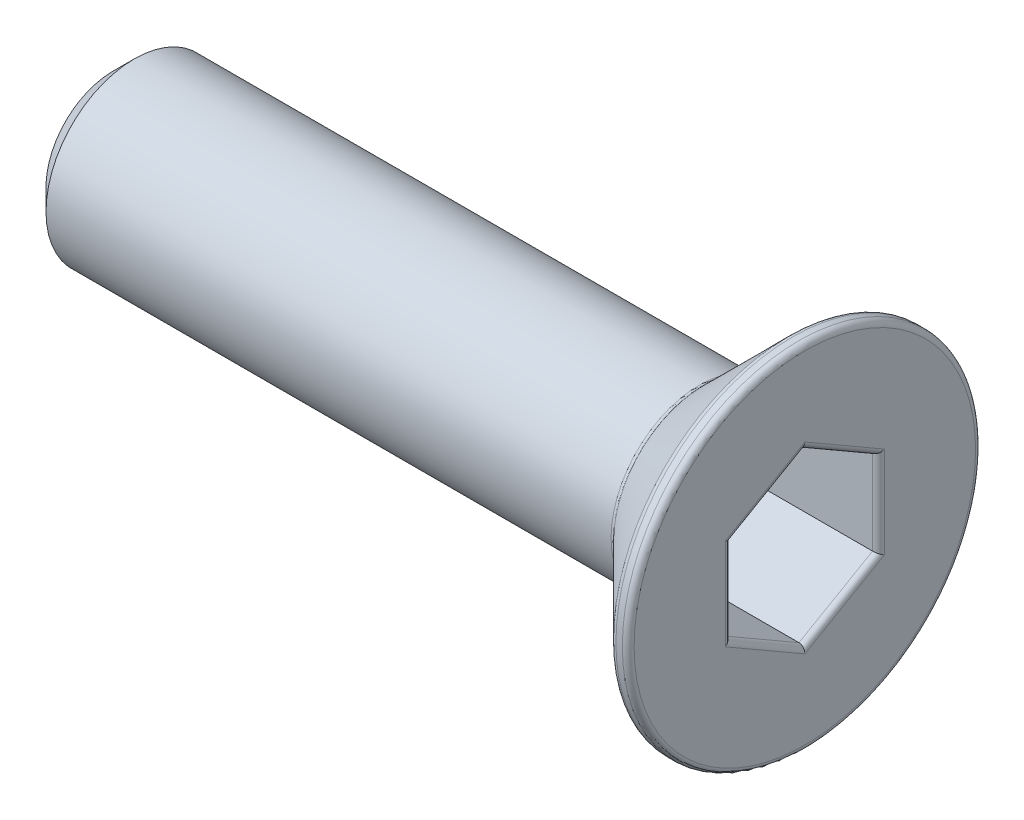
ISO-10303-21;
HEADER;
FILE_DESCRIPTION(('STEP AP214'),'2;1');
FILE_NAME('part.step','',(''),(''),'','','');
FILE_SCHEMA(('AUTOMOTIVE_DESIGN { 1 0 10303 214 1 1 1 1 }'));
ENDSEC;
DATA;
#1=APPLICATION_CONTEXT('core data for automotive mechanical design processes');
#2=APPLICATION_PROTOCOL_DEFINITION('international standard','automotive_design',2000,#1);
#3=PRODUCT_CONTEXT('',#1,'mechanical');
#4=PRODUCT('Part','Part','',(#3));
#5=PRODUCT_RELATED_PRODUCT_CATEGORY('part','',(#4));
#6=PRODUCT_DEFINITION_FORMATION('','',#4);
#7=PRODUCT_DEFINITION_CONTEXT('part definition',#1,'design');
#8=PRODUCT_DEFINITION('design','',#6,#7);
#9=PRODUCT_DEFINITION_SHAPE('','',#8);
#10=(LENGTH_UNIT() NAMED_UNIT(*) SI_UNIT(.MILLI.,.METRE.));
#11=(NAMED_UNIT(*) PLANE_ANGLE_UNIT() SI_UNIT($,.RADIAN.));
#12=(NAMED_UNIT(*) SI_UNIT($,.STERADIAN.) SOLID_ANGLE_UNIT());
#13=UNCERTAINTY_MEASURE_WITH_UNIT(LENGTH_MEASURE(1.E-05),#10,'distance_accuracy_value','');
#14=(GEOMETRIC_REPRESENTATION_CONTEXT(3) GLOBAL_UNCERTAINTY_ASSIGNED_CONTEXT((#13)) GLOBAL_UNIT_ASSIGNED_CONTEXT((#10,
#11,#12)) REPRESENTATION_CONTEXT('',''));
#15=CARTESIAN_POINT('',(0.,0.,0.));
#16=DIRECTION('',(0.,0.,1.));
#17=DIRECTION('',(1.,0.,0.));
#18=AXIS2_PLACEMENT_3D('',#15,#16,#17);
#19=CARTESIAN_POINT('',(0.,0.,0.));
#20=DIRECTION('',(-1.,0.,0.));
#21=DIRECTION('',(0.,0.,1.));
#22=AXIS2_PLACEMENT_3D('',#19,#20,#21);
#23=CYLINDRICAL_SURFACE('',#22,1.5);
#24=CARTESIAN_POINT('',(9.95857864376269,0.,0.));
#25=DIRECTION('',(-1.,0.,0.));
#26=DIRECTION('',(0.,0.,1.));
#27=AXIS2_PLACEMENT_3D('',#24,#25,#26);
#28=CIRCLE('',#27,1.5);
#29=CARTESIAN_POINT('',(9.95857864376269,0.,1.5));
#30=VERTEX_POINT('',#29);
#31=EDGE_CURVE('E161',#30,#30,#28,.T.);
#32=ORIENTED_EDGE('',*,*,#31,.T.);
#33=EDGE_LOOP('',(#32));
#34=FACE_BOUND('',#33,.T.);
#35=CARTESIAN_POINT('',(0.361358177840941,0.,0.));
#36=DIRECTION('',(1.,0.,0.));
#37=DIRECTION('',(0.,0.,-1.));
#38=AXIS2_PLACEMENT_3D('',#35,#36,#37);
#39=CIRCLE('',#38,1.5);
#40=CARTESIAN_POINT('',(0.361358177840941,0.,-1.5));
#41=VERTEX_POINT('',#40);
#42=EDGE_CURVE('E121',#41,#41,#39,.F.);
#43=ORIENTED_EDGE('',*,*,#42,.F.);
#44=EDGE_LOOP('',(#43));
#45=FACE_BOUND('',#44,.T.);
#46=ADVANCED_FACE('F30',(#34,#45),#23,.T.);
#47=CARTESIAN_POINT('',(11.75,3.,0.));
#48=DIRECTION('',(-1.,0.,0.));
#49=DIRECTION('',(0.,0.,1.));
#50=AXIS2_PLACEMENT_3D('',#47,#48,#49);
#51=PLANE('',#50);
#52=CARTESIAN_POINT('',(11.75,0.,0.));
#53=DIRECTION('',(-1.,0.,0.));
#54=DIRECTION('',(0.,0.,1.));
#55=AXIS2_PLACEMENT_3D('',#52,#53,#54);
#56=CIRCLE('',#55,2.9);
#57=CARTESIAN_POINT('',(11.75,0.,2.9));
#58=VERTEX_POINT('',#57);
#59=EDGE_CURVE('E177',#58,#58,#56,.F.);
#60=ORIENTED_EDGE('',*,*,#59,.T.);
#61=EDGE_LOOP('',(#60));
#62=FACE_BOUND('',#61,.T.);
#63=DIRECTION('',(0.,0.50000039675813,0.866025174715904));
#64=VECTOR('',#63,1.);
#65=CARTESIAN_POINT('',(11.75,1.91913517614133,0.624038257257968));
#66=LINE('',#65,#64);
#67=CARTESIAN_POINT('',(11.75,1.55884572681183,-7.14164727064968E-07));
#68=VERTEX_POINT('',#67);
#69=CARTESIAN_POINT('',(11.75,0.779422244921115,-1.35000035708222));
#70=VERTEX_POINT('',#69);
#71=EDGE_CURVE('E172',#68,#70,#66,.F.);
#72=ORIENTED_EDGE('',*,*,#71,.T.);
#73=DIRECTION('',(0.,0.999999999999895,-4.58136886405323E-07));
#74=VECTOR('',#73,1.);
#75=CARTESIAN_POINT('',(11.75,2.99999938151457,-1.35000137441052));
#76=LINE('',#75,#74);
#77=CARTESIAN_POINT('',(11.75,-0.77942348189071,-1.34999964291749));
#78=VERTEX_POINT('',#77);
#79=EDGE_CURVE('E174',#70,#78,#76,.F.);
#80=ORIENTED_EDGE('',*,*,#79,.T.);
#81=DIRECTION('',(0.,0.499999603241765,-0.866025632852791));
#82=VECTOR('',#81,1.);
#83=CARTESIAN_POINT('',(11.75,-0.4191357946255,-1.97403688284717));
#84=LINE('',#83,#82);
#85=CARTESIAN_POINT('',(11.75,-1.55884572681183,7.14164728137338E-07));
#86=VERTEX_POINT('',#85);
#87=EDGE_CURVE('E164',#78,#86,#84,.F.);
#88=ORIENTED_EDGE('',*,*,#87,.T.);
#89=DIRECTION('',(0.,-0.50000039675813,-0.866025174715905));
#90=VECTOR('',#89,1.);
#91=CARTESIAN_POINT('',(11.75,-0.41913279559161,1.97403932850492));
#92=LINE('',#91,#90);
#93=CARTESIAN_POINT('',(11.75,-0.779422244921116,1.35000035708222));
#94=VERTEX_POINT('',#93);
#95=EDGE_CURVE('E166',#86,#94,#92,.F.);
#96=ORIENTED_EDGE('',*,*,#95,.T.);
#97=DIRECTION('',(0.,-0.999999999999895,4.58136886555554E-07));
#98=VECTOR('',#97,1.);
#99=CARTESIAN_POINT('',(11.75,3.00000061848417,1.3499986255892));
#100=LINE('',#99,#98);
#101=CARTESIAN_POINT('',(11.75,0.779423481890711,1.34999964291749));
#102=VERTEX_POINT('',#101);
#103=EDGE_CURVE('E168',#94,#102,#100,.F.);
#104=ORIENTED_EDGE('',*,*,#103,.T.);
#105=DIRECTION('',(0.,-0.499999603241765,0.866025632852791));
#106=VECTOR('',#105,1.);
#107=CARTESIAN_POINT('',(11.75,1.91913341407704,-0.624037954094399));
#108=LINE('',#107,#106);
#109=EDGE_CURVE('E170',#102,#68,#108,.F.);
#110=ORIENTED_EDGE('',*,*,#109,.T.);
#111=EDGE_LOOP('',(#72,#80,#88,#96,#104,#110));
#112=FACE_BOUND('',#111,.T.);
#113=ADVANCED_FACE('F32',(#62,#112),#51,.F.);
#114=CARTESIAN_POINT('',(0.,0.,0.));
#115=DIRECTION('',(-1.,0.,0.));
#116=DIRECTION('',(0.,0.,1.));
#117=AXIS2_PLACEMENT_3D('',#114,#115,#116);
#118=CYLINDRICAL_SURFACE('',#117,3.);
#119=CARTESIAN_POINT('',(11.5414213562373,0.,0.));
#120=DIRECTION('',(1.,0.,0.));
#121=DIRECTION('',(0.,0.,-1.));
#122=AXIS2_PLACEMENT_3D('',#119,#120,#121);
#123=CIRCLE('',#122,3.);
#124=CARTESIAN_POINT('',(11.5414213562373,0.,-3.));
#125=VERTEX_POINT('',#124);
#126=EDGE_CURVE('E158',#125,#125,#123,.T.);
#127=ORIENTED_EDGE('',*,*,#126,.T.);
#128=EDGE_LOOP('',(#127));
#129=FACE_BOUND('',#128,.T.);
#130=CARTESIAN_POINT('',(11.65,0.,0.));
#131=DIRECTION('',(-1.,0.,0.));
#132=DIRECTION('',(0.,0.,1.));
#133=AXIS2_PLACEMENT_3D('',#130,#131,#132);
#134=CIRCLE('',#133,3.);
#135=CARTESIAN_POINT('',(11.65,0.,3.));
#136=VERTEX_POINT('',#135);
#137=EDGE_CURVE('E155',#136,#136,#134,.T.);
#138=ORIENTED_EDGE('',*,*,#137,.T.);
#139=EDGE_LOOP('',(#138));
#140=FACE_BOUND('',#139,.T.);
#141=ADVANCED_FACE('F244',(#129,#140),#118,.T.);
#142=CARTESIAN_POINT('',(11.5,0.,0.));
#143=DIRECTION('',(1.,0.,0.));
#144=DIRECTION('',(0.,0.,-1.));
#145=AXIS2_PLACEMENT_3D('',#142,#143,#144);
#146=CONICAL_SURFACE('',#145,3.,0.78539816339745);
#147=CARTESIAN_POINT('',(11.4707106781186,0.,0.));
#148=DIRECTION('',(-1.,0.,0.));
#149=DIRECTION('',(0.,0.,1.));
#150=AXIS2_PLACEMENT_3D('',#147,#148,#149);
#151=CIRCLE('',#150,2.97071067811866);
#152=CARTESIAN_POINT('',(11.4707106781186,0.,2.97071067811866));
#153=VERTEX_POINT('',#152);
#154=EDGE_CURVE('E152',#153,#153,#151,.T.);
#155=ORIENTED_EDGE('',*,*,#154,.T.);
#156=EDGE_LOOP('',(#155));
#157=FACE_BOUND('',#156,.T.);
#158=CARTESIAN_POINT('',(10.0292893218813,0.,0.));
#159=DIRECTION('',(1.,0.,0.));
#160=DIRECTION('',(0.,0.,-1.));
#161=AXIS2_PLACEMENT_3D('',#158,#159,#160);
#162=CIRCLE('',#161,1.52928932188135);
#163=CARTESIAN_POINT('',(10.0292893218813,0.,-1.52928932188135));
#164=VERTEX_POINT('',#163);
#165=EDGE_CURVE('E137',#164,#164,#162,.T.);
#166=ORIENTED_EDGE('',*,*,#165,.T.);
#167=EDGE_LOOP('',(#166));
#168=FACE_BOUND('',#167,.T.);
#169=ADVANCED_FACE('F251',(#157,#168),#146,.T.);
#170=CARTESIAN_POINT('',(9.75,-0.721687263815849,1.25000033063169));
#171=DIRECTION('',(0.,-0.866025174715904,0.50000039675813));
#172=DIRECTION('',(0.,-0.50000039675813,-0.866025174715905));
#173=AXIS2_PLACEMENT_3D('',#170,#171,#172);
#174=PLANE('',#173);
#175=DIRECTION('',(1.,0.,0.));
#176=VECTOR('',#175,1.);
#177=CARTESIAN_POINT('',(9.75,-0.721687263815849,1.25000033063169));
#178=LINE('',#177,#176);
#179=CARTESIAN_POINT('',(9.75,-0.721687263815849,1.25000033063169));
#180=VERTEX_POINT('',#179);
#181=CARTESIAN_POINT('',(11.65,-0.721687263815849,1.25000033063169));
#182=VERTEX_POINT('',#181);
#183=EDGE_CURVE('E135',#180,#182,#178,.T.);
#184=ORIENTED_EDGE('',*,*,#183,.T.);
#185=DIRECTION('',(0.,-0.50000039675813,-0.866025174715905));
#186=VECTOR('',#185,1.);
#187=CARTESIAN_POINT('',(11.65,-0.721687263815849,1.25000033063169));
#188=LINE('',#187,#186);
#189=CARTESIAN_POINT('',(11.65,-1.44337567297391,6.61263637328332E-07));
#190=VERTEX_POINT('',#189);
#191=EDGE_CURVE('E38',#182,#190,#188,.T.);
#192=ORIENTED_EDGE('',*,*,#191,.T.);
#193=DIRECTION('',(1.,0.,0.));
#194=VECTOR('',#193,1.);
#195=CARTESIAN_POINT('',(9.75,-1.44337567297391,6.61263637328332E-07));
#196=LINE('',#195,#194);
#197=CARTESIAN_POINT('',(9.75,-1.44337567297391,6.61263637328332E-07));
#198=VERTEX_POINT('',#197);
#199=EDGE_CURVE('E98',#198,#190,#196,.T.);
#200=ORIENTED_EDGE('',*,*,#199,.F.);
#201=DIRECTION('',(0.,-0.50000039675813,-0.866025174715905));
#202=VECTOR('',#201,1.);
#203=CARTESIAN_POINT('',(9.75,-0.721687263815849,1.25000033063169));
#204=LINE('',#203,#202);
#205=EDGE_CURVE('E102',#180,#198,#204,.T.);
#206=ORIENTED_EDGE('',*,*,#205,.F.);
#207=EDGE_LOOP('',(#184,#192,#200,#206));
#208=FACE_BOUND('',#207,.T.);
#209=ADVANCED_FACE('F100',(#208),#174,.F.);
#210=CARTESIAN_POINT('',(9.75,0.721688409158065,1.24999966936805));
#211=DIRECTION('',(0.,4.58136886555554E-07,0.999999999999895));
#212=DIRECTION('',(0.,-0.999999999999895,4.58136886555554E-07));
#213=AXIS2_PLACEMENT_3D('',#210,#211,#212);
#214=PLANE('',#213);
#215=DIRECTION('',(1.,0.,0.));
#216=VECTOR('',#215,1.);
#217=CARTESIAN_POINT('',(9.75,0.721688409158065,1.24999966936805));
#218=LINE('',#217,#216);
#219=CARTESIAN_POINT('',(9.75,0.721688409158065,1.24999966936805));
#220=VERTEX_POINT('',#219);
#221=CARTESIAN_POINT('',(11.65,0.721688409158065,1.24999966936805));
#222=VERTEX_POINT('',#221);
#223=EDGE_CURVE('E138',#220,#222,#218,.T.);
#224=ORIENTED_EDGE('',*,*,#223,.T.);
#225=DIRECTION('',(0.,-0.999999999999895,4.58136886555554E-07));
#226=VECTOR('',#225,1.);
#227=CARTESIAN_POINT('',(11.65,0.721688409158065,1.24999966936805));
#228=LINE('',#227,#226);
#229=EDGE_CURVE('E52',#222,#182,#228,.T.);
#230=ORIENTED_EDGE('',*,*,#229,.T.);
#231=ORIENTED_EDGE('',*,*,#183,.F.);
#232=DIRECTION('',(0.,-0.999999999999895,4.58136886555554E-07));
#233=VECTOR('',#232,1.);
#234=CARTESIAN_POINT('',(9.75,0.721688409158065,1.24999966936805));
#235=LINE('',#234,#233);
#236=EDGE_CURVE('E107',#220,#180,#235,.T.);
#237=ORIENTED_EDGE('',*,*,#236,.F.);
#238=EDGE_LOOP('',(#224,#230,#231,#237));
#239=FACE_BOUND('',#238,.T.);
#240=ADVANCED_FACE('F195',(#239),#214,.F.);
#241=CARTESIAN_POINT('',(9.75,1.44337567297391,-6.61263636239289E-07));
#242=DIRECTION('',(0.,0.866025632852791,0.499999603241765));
#243=DIRECTION('',(0.,-0.499999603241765,0.866025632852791));
#244=AXIS2_PLACEMENT_3D('',#241,#242,#243);
#245=PLANE('',#244);
#246=DIRECTION('',(1.,0.,0.));
#247=VECTOR('',#246,1.);
#248=CARTESIAN_POINT('',(9.75,1.44337567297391,-6.61263636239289E-07));
#249=LINE('',#248,#247);
#250=CARTESIAN_POINT('',(9.75,1.44337567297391,-6.61263636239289E-07));
#251=VERTEX_POINT('',#250);
#252=CARTESIAN_POINT('',(11.65,1.44337567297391,-6.61263636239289E-07));
#253=VERTEX_POINT('',#252);
#254=EDGE_CURVE('E140',#251,#253,#249,.T.);
#255=ORIENTED_EDGE('',*,*,#254,.T.);
#256=DIRECTION('',(0.,-0.499999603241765,0.866025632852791));
#257=VECTOR('',#256,1.);
#258=CARTESIAN_POINT('',(11.65,1.44337567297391,-6.61263636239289E-07));
#259=LINE('',#258,#257);
#260=EDGE_CURVE('E185',#253,#222,#259,.T.);
#261=ORIENTED_EDGE('',*,*,#260,.T.);
#262=ORIENTED_EDGE('',*,*,#223,.F.);
#263=DIRECTION('',(0.,-0.499999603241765,0.866025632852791));
#264=VECTOR('',#263,1.);
#265=CARTESIAN_POINT('',(9.75,1.44337567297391,-6.61263636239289E-07));
#266=LINE('',#265,#264);
#267=EDGE_CURVE('E132',#251,#220,#266,.T.);
#268=ORIENTED_EDGE('',*,*,#267,.F.);
#269=EDGE_LOOP('',(#255,#261,#262,#268));
#270=FACE_BOUND('',#269,.T.);
#271=ADVANCED_FACE('F189',(#270),#245,.F.);
#272=CARTESIAN_POINT('',(9.75,0.721687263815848,-1.25000033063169));
#273=DIRECTION('',(0.,0.866025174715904,-0.50000039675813));
#274=DIRECTION('',(0.,0.50000039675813,0.866025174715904));
#275=AXIS2_PLACEMENT_3D('',#272,#273,#274);
#276=PLANE('',#275);
#277=DIRECTION('',(1.,0.,0.));
#278=VECTOR('',#277,1.);
#279=CARTESIAN_POINT('',(9.75,0.721687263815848,-1.25000033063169));
#280=LINE('',#279,#278);
#281=CARTESIAN_POINT('',(9.75,0.721687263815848,-1.25000033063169));
#282=VERTEX_POINT('',#281);
#283=CARTESIAN_POINT('',(11.65,0.721687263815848,-1.25000033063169));
#284=VERTEX_POINT('',#283);
#285=EDGE_CURVE('E143',#282,#284,#280,.T.);
#286=ORIENTED_EDGE('',*,*,#285,.T.);
#287=DIRECTION('',(0.,0.50000039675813,0.866025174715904));
#288=VECTOR('',#287,1.);
#289=CARTESIAN_POINT('',(11.65,0.721687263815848,-1.25000033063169));
#290=LINE('',#289,#288);
#291=EDGE_CURVE('E183',#284,#253,#290,.T.);
#292=ORIENTED_EDGE('',*,*,#291,.T.);
#293=ORIENTED_EDGE('',*,*,#254,.F.);
#294=DIRECTION('',(0.,0.50000039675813,0.866025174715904));
#295=VECTOR('',#294,1.);
#296=CARTESIAN_POINT('',(9.75,0.721687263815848,-1.25000033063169));
#297=LINE('',#296,#295);
#298=EDGE_CURVE('E129',#282,#251,#297,.T.);
#299=ORIENTED_EDGE('',*,*,#298,.F.);
#300=EDGE_LOOP('',(#286,#292,#293,#299));
#301=FACE_BOUND('',#300,.T.);
#302=ADVANCED_FACE('F229',(#301),#276,.F.);
#303=CARTESIAN_POINT('',(9.75,-0.721688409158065,-1.24999966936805));
#304=DIRECTION('',(0.,-4.58136886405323E-07,-0.999999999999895));
#305=DIRECTION('',(0.,0.999999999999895,-4.58136886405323E-07));
#306=AXIS2_PLACEMENT_3D('',#303,#304,#305);
#307=PLANE('',#306);
#308=DIRECTION('',(1.,0.,0.));
#309=VECTOR('',#308,1.);
#310=CARTESIAN_POINT('',(9.75,-0.721688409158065,-1.24999966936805));
#311=LINE('',#310,#309);
#312=CARTESIAN_POINT('',(9.75,-0.721688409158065,-1.24999966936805));
#313=VERTEX_POINT('',#312);
#314=CARTESIAN_POINT('',(11.65,-0.721688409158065,-1.24999966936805));
#315=VERTEX_POINT('',#314);
#316=EDGE_CURVE('E106',#313,#315,#311,.T.);
#317=ORIENTED_EDGE('',*,*,#316,.T.);
#318=DIRECTION('',(0.,0.999999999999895,-4.58136886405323E-07));
#319=VECTOR('',#318,1.);
#320=CARTESIAN_POINT('',(11.65,-0.721688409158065,-1.24999966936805));
#321=LINE('',#320,#319);
#322=EDGE_CURVE('E180',#315,#284,#321,.T.);
#323=ORIENTED_EDGE('',*,*,#322,.T.);
#324=ORIENTED_EDGE('',*,*,#285,.F.);
#325=DIRECTION('',(0.,0.999999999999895,-4.58136886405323E-07));
#326=VECTOR('',#325,1.);
#327=CARTESIAN_POINT('',(9.75,-0.721688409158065,-1.24999966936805));
#328=LINE('',#327,#326);
#329=EDGE_CURVE('E116',#313,#282,#328,.T.);
#330=ORIENTED_EDGE('',*,*,#329,.F.);
#331=EDGE_LOOP('',(#317,#323,#324,#330));
#332=FACE_BOUND('',#331,.T.);
#333=ADVANCED_FACE('F226',(#332),#307,.F.);
#334=CARTESIAN_POINT('',(9.75,-1.44337567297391,6.61263637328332E-07));
#335=DIRECTION('',(0.,-0.866025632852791,-0.499999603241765));
#336=DIRECTION('',(0.,0.499999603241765,-0.866025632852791));
#337=AXIS2_PLACEMENT_3D('',#334,#335,#336);
#338=PLANE('',#337);
#339=ORIENTED_EDGE('',*,*,#199,.T.);
#340=DIRECTION('',(0.,0.499999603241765,-0.866025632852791));
#341=VECTOR('',#340,1.);
#342=CARTESIAN_POINT('',(11.65,-1.44337567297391,6.61263637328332E-07));
#343=LINE('',#342,#341);
#344=EDGE_CURVE('E11',#190,#315,#343,.T.);
#345=ORIENTED_EDGE('',*,*,#344,.T.);
#346=ORIENTED_EDGE('',*,*,#316,.F.);
#347=DIRECTION('',(0.,0.499999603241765,-0.866025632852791));
#348=VECTOR('',#347,1.);
#349=CARTESIAN_POINT('',(9.75,-1.44337567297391,6.61263637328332E-07));
#350=LINE('',#349,#348);
#351=EDGE_CURVE('E110',#198,#313,#350,.T.);
#352=ORIENTED_EDGE('',*,*,#351,.F.);
#353=EDGE_LOOP('',(#339,#345,#346,#352));
#354=FACE_BOUND('',#353,.T.);
#355=ADVANCED_FACE('F111',(#354),#338,.F.);
#356=CARTESIAN_POINT('',(9.75,-0.721687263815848,1.25000033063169));
#357=DIRECTION('',(-1.,0.,0.));
#358=DIRECTION('',(0.,0.,1.));
#359=AXIS2_PLACEMENT_3D('',#356,#357,#358);
#360=PLANE('',#359);
#361=ORIENTED_EDGE('',*,*,#205,.T.);
#362=ORIENTED_EDGE('',*,*,#351,.T.);
#363=ORIENTED_EDGE('',*,*,#329,.T.);
#364=ORIENTED_EDGE('',*,*,#298,.T.);
#365=ORIENTED_EDGE('',*,*,#267,.T.);
#366=ORIENTED_EDGE('',*,*,#236,.T.);
#367=EDGE_LOOP('',(#361,#362,#363,#364,#365,#366));
#368=FACE_BOUND('',#367,.T.);
#369=ADVANCED_FACE('F118',(#368),#360,.F.);
#370=CARTESIAN_POINT('',(-0.360767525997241,0.,0.));
#371=DIRECTION('',(1.,0.,0.));
#372=DIRECTION('',(0.,0.,-1.));
#373=AXIS2_PLACEMENT_3D('',#370,#371,#372);
#374=CONICAL_SURFACE('',#373,0.777874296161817,0.785398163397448);
#375=CARTESIAN_POINT('',(0.,0.,0.));
#376=DIRECTION('',(1.,0.,0.));
#377=DIRECTION('',(0.,0.,-1.));
#378=AXIS2_PLACEMENT_3D('',#375,#376,#377);
#379=CIRCLE('',#378,1.13864182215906);
#380=CARTESIAN_POINT('',(0.,0.,-1.13864182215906));
#381=VERTEX_POINT('',#380);
#382=EDGE_CURVE('E124',#381,#381,#379,.T.);
#383=ORIENTED_EDGE('',*,*,#382,.T.);
#384=EDGE_LOOP('',(#383));
#385=FACE_BOUND('',#384,.T.);
#386=ORIENTED_EDGE('',*,*,#42,.T.);
#387=EDGE_LOOP('',(#386));
#388=FACE_BOUND('',#387,.T.);
#389=ADVANCED_FACE('F282',(#385,#388),#374,.T.);
#390=CARTESIAN_POINT('',(0.,0.,0.));
#391=DIRECTION('',(1.,0.,0.));
#392=DIRECTION('',(0.,0.,-1.));
#393=AXIS2_PLACEMENT_3D('',#390,#391,#392);
#394=PLANE('',#393);
#395=ORIENTED_EDGE('',*,*,#382,.F.);
#396=EDGE_LOOP('',(#395));
#397=FACE_BOUND('',#396,.T.);
#398=ADVANCED_FACE('F249',(#397),#394,.F.);
#399=CARTESIAN_POINT('',(11.5414213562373,0.,0.));
#400=DIRECTION('',(1.,0.,0.));
#401=DIRECTION('',(0.,0.,-1.));
#402=AXIS2_PLACEMENT_3D('',#399,#400,#401);
#403=TOROIDAL_SURFACE('',#402,2.9,0.1);
#404=ORIENTED_EDGE('',*,*,#126,.F.);
#405=EDGE_LOOP('',(#404));
#406=FACE_BOUND('',#405,.T.);
#407=ORIENTED_EDGE('',*,*,#154,.F.);
#408=EDGE_LOOP('',(#407));
#409=FACE_BOUND('',#408,.T.);
#410=ADVANCED_FACE('F273',(#406,#409),#403,.T.);
#411=CARTESIAN_POINT('',(9.95857864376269,0.,0.));
#412=DIRECTION('',(-1.,0.,0.));
#413=DIRECTION('',(0.,0.,1.));
#414=AXIS2_PLACEMENT_3D('',#411,#412,#413);
#415=TOROIDAL_SURFACE('',#414,1.6,0.1);
#416=ORIENTED_EDGE('',*,*,#165,.F.);
#417=EDGE_LOOP('',(#416));
#418=FACE_BOUND('',#417,.T.);
#419=ORIENTED_EDGE('',*,*,#31,.F.);
#420=EDGE_LOOP('',(#419));
#421=FACE_BOUND('',#420,.T.);
#422=ADVANCED_FACE('F264',(#418,#421),#415,.F.);
#423=CARTESIAN_POINT('',(11.65,0.,0.));
#424=DIRECTION('',(-1.,0.,0.));
#425=DIRECTION('',(0.,0.,1.));
#426=AXIS2_PLACEMENT_3D('',#423,#424,#425);
#427=TOROIDAL_SURFACE('',#426,2.9,0.1);
#428=ORIENTED_EDGE('',*,*,#59,.F.);
#429=EDGE_LOOP('',(#428));
#430=FACE_BOUND('',#429,.T.);
#431=ORIENTED_EDGE('',*,*,#137,.F.);
#432=EDGE_LOOP('',(#431));
#433=FACE_BOUND('',#432,.T.);
#434=ADVANCED_FACE('F262',(#430,#433),#427,.T.);
#435=CARTESIAN_POINT('',(11.65,0.721688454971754,1.34999966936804));
#436=DIRECTION('',(0.,-0.999999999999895,4.58136886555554E-07));
#437=DIRECTION('',(0.,-4.58136886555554E-07,-0.999999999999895));
#438=AXIS2_PLACEMENT_3D('',#435,#436,#437);
#439=CYLINDRICAL_SURFACE('',#438,0.1);
#440=CARTESIAN_POINT('',(11.65,0.779423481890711,1.34999964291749));
#441=DIRECTION('',(0.,-0.866025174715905,0.50000039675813));
#442=DIRECTION('',(0.,0.50000039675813,0.866025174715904));
#443=AXIS2_PLACEMENT_3D('',#440,#441,#442);
#444=ELLIPSE('',#443,0.115470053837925,0.1);
#445=EDGE_CURVE('E201',#102,#222,#444,.F.);
#446=ORIENTED_EDGE('',*,*,#445,.F.);
#447=ORIENTED_EDGE('',*,*,#103,.F.);
#448=CARTESIAN_POINT('',(11.65,-0.779422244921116,1.35000035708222));
#449=DIRECTION('',(0.,-0.866025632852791,-0.499999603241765));
#450=DIRECTION('',(0.,-0.499999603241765,0.866025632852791));
#451=AXIS2_PLACEMENT_3D('',#448,#449,#450);
#452=ELLIPSE('',#451,0.115470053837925,0.1);
#453=EDGE_CURVE('E149',#182,#94,#452,.T.);
#454=ORIENTED_EDGE('',*,*,#453,.F.);
#455=ORIENTED_EDGE('',*,*,#229,.F.);
#456=EDGE_LOOP('',(#446,#447,#454,#455));
#457=FACE_BOUND('',#456,.T.);
#458=ADVANCED_FACE('F199',(#457),#439,.T.);
#459=CARTESIAN_POINT('',(11.65,-0.808289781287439,1.3000003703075));
#460=DIRECTION('',(0.,-0.50000039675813,-0.866025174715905));
#461=DIRECTION('',(0.,0.866025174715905,-0.50000039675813));
#462=AXIS2_PLACEMENT_3D('',#459,#460,#461);
#463=CYLINDRICAL_SURFACE('',#462,0.1);
#464=ORIENTED_EDGE('',*,*,#453,.T.);
#465=ORIENTED_EDGE('',*,*,#95,.F.);
#466=CARTESIAN_POINT('',(11.65,-1.55884572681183,7.14164728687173E-07));
#467=DIRECTION('',(0.,-4.58136886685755E-07,-0.999999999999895));
#468=DIRECTION('',(0.,-0.999999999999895,4.58136886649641E-07));
#469=AXIS2_PLACEMENT_3D('',#466,#467,#468);
#470=ELLIPSE('',#469,0.115470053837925,0.1);
#471=EDGE_CURVE('E205',#190,#86,#470,.T.);
#472=ORIENTED_EDGE('',*,*,#471,.F.);
#473=ORIENTED_EDGE('',*,*,#191,.F.);
#474=EDGE_LOOP('',(#464,#465,#472,#473));
#475=FACE_BOUND('',#474,.T.);
#476=ADVANCED_FACE('F271',(#475),#463,.T.);
#477=CARTESIAN_POINT('',(11.65,1.52997823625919,0.0499992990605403));
#478=DIRECTION('',(0.,-0.499999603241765,0.866025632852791));
#479=DIRECTION('',(0.,-0.866025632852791,-0.499999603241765));
#480=AXIS2_PLACEMENT_3D('',#477,#478,#479);
#481=CYLINDRICAL_SURFACE('',#480,0.1);
#482=ORIENTED_EDGE('',*,*,#445,.T.);
#483=ORIENTED_EDGE('',*,*,#260,.F.);
#484=CARTESIAN_POINT('',(11.65,1.55884572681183,-7.14164727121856E-07));
#485=DIRECTION('',(0.,4.58136886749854E-07,0.999999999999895));
#486=DIRECTION('',(0.,0.999999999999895,-4.5813688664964E-07));
#487=AXIS2_PLACEMENT_3D('',#484,#485,#486);
#488=ELLIPSE('',#487,0.115470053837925,0.1);
#489=EDGE_CURVE('E208',#68,#253,#488,.F.);
#490=ORIENTED_EDGE('',*,*,#489,.F.);
#491=ORIENTED_EDGE('',*,*,#109,.F.);
#492=EDGE_LOOP('',(#482,#483,#490,#491));
#493=FACE_BOUND('',#492,.T.);
#494=ADVANCED_FACE('F204',(#493),#481,.T.);
#495=CARTESIAN_POINT('',(11.65,-1.52997823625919,-0.0499992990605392));
#496=DIRECTION('',(0.,0.499999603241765,-0.866025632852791));
#497=DIRECTION('',(0.,0.866025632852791,0.499999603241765));
#498=AXIS2_PLACEMENT_3D('',#495,#496,#497);
#499=CYLINDRICAL_SURFACE('',#498,0.1);
#500=ORIENTED_EDGE('',*,*,#471,.T.);
#501=ORIENTED_EDGE('',*,*,#87,.F.);
#502=CARTESIAN_POINT('',(11.65,-0.77942348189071,-1.34999964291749));
#503=DIRECTION('',(0.,0.866025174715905,-0.50000039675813));
#504=DIRECTION('',(0.,0.50000039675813,0.866025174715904));
#505=AXIS2_PLACEMENT_3D('',#502,#503,#504);
#506=ELLIPSE('',#505,0.115470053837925,0.1);
#507=EDGE_CURVE('E212',#315,#78,#506,.T.);
#508=ORIENTED_EDGE('',*,*,#507,.F.);
#509=ORIENTED_EDGE('',*,*,#344,.F.);
#510=EDGE_LOOP('',(#500,#501,#508,#509));
#511=FACE_BOUND('',#510,.T.);
#512=ADVANCED_FACE('F349',(#511),#499,.T.);
#513=CARTESIAN_POINT('',(11.65,0.808289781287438,-1.3000003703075));
#514=DIRECTION('',(0.,0.50000039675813,0.866025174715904));
#515=DIRECTION('',(0.,-0.866025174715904,0.50000039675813));
#516=AXIS2_PLACEMENT_3D('',#513,#514,#515);
#517=CYLINDRICAL_SURFACE('',#516,0.1);
#518=ORIENTED_EDGE('',*,*,#489,.T.);
#519=ORIENTED_EDGE('',*,*,#291,.F.);
#520=CARTESIAN_POINT('',(11.65,0.779422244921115,-1.35000035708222));
#521=DIRECTION('',(0.,0.866025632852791,0.499999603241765));
#522=DIRECTION('',(0.,0.499999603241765,-0.866025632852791));
#523=AXIS2_PLACEMENT_3D('',#520,#521,#522);
#524=ELLIPSE('',#523,0.115470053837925,0.1);
#525=EDGE_CURVE('E214',#70,#284,#524,.F.);
#526=ORIENTED_EDGE('',*,*,#525,.F.);
#527=ORIENTED_EDGE('',*,*,#71,.F.);
#528=EDGE_LOOP('',(#518,#519,#526,#527));
#529=FACE_BOUND('',#528,.T.);
#530=ADVANCED_FACE('F223',(#529),#517,.T.);
#531=CARTESIAN_POINT('',(11.65,-0.721688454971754,-1.34999966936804));
#532=DIRECTION('',(0.,0.999999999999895,-4.58136886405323E-07));
#533=DIRECTION('',(0.,4.58136886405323E-07,0.999999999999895));
#534=AXIS2_PLACEMENT_3D('',#531,#532,#533);
#535=CYLINDRICAL_SURFACE('',#534,0.1);
#536=ORIENTED_EDGE('',*,*,#507,.T.);
#537=ORIENTED_EDGE('',*,*,#79,.F.);
#538=ORIENTED_EDGE('',*,*,#525,.T.);
#539=ORIENTED_EDGE('',*,*,#322,.F.);
#540=EDGE_LOOP('',(#536,#537,#538,#539));
#541=FACE_BOUND('',#540,.T.);
#542=ADVANCED_FACE('F220',(#541),#535,.T.);
#543=CLOSED_SHELL('',(#46,#113,#141,#169,#209,#240,#271,#302,#333,#355,#369,#389,#398,#410,#422,
#434,#458,#476,#494,#512,#530,#542));
#544=MANIFOLD_SOLID_BREP('B2',#543);
#545=ADVANCED_BREP_SHAPE_REPRESENTATION('',(#18,#544),#14);
#546=SHAPE_DEFINITION_REPRESENTATION(#9,#545);
ENDSEC;
END-ISO-10303-21;
